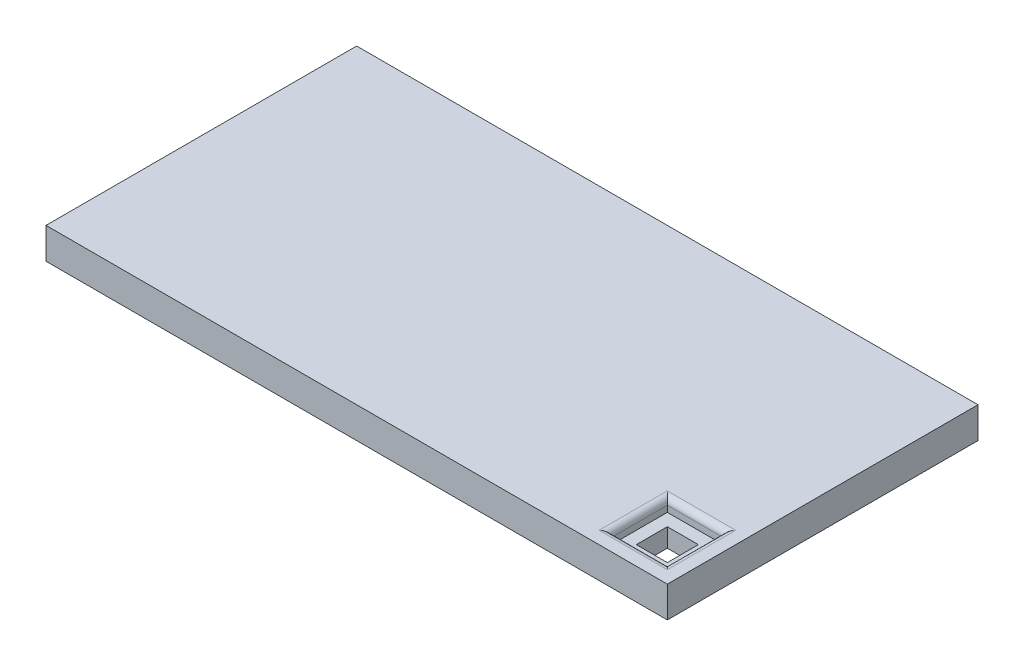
ISO-10303-21;
HEADER;
FILE_DESCRIPTION(('STEP AP214'),'2;1');
FILE_NAME('part.step','',(''),(''),'','','');
FILE_SCHEMA(('AUTOMOTIVE_DESIGN { 1 0 10303 214 1 1 1 1 }'));
ENDSEC;
DATA;
#1=APPLICATION_CONTEXT('core data for automotive mechanical design processes');
#2=APPLICATION_PROTOCOL_DEFINITION('international standard','automotive_design',2000,#1);
#3=PRODUCT_CONTEXT('',#1,'mechanical');
#4=PRODUCT('Part','Part','',(#3));
#5=PRODUCT_RELATED_PRODUCT_CATEGORY('part','',(#4));
#6=PRODUCT_DEFINITION_FORMATION('','',#4);
#7=PRODUCT_DEFINITION_CONTEXT('part definition',#1,'design');
#8=PRODUCT_DEFINITION('design','',#6,#7);
#9=PRODUCT_DEFINITION_SHAPE('','',#8);
#10=(LENGTH_UNIT() NAMED_UNIT(*) SI_UNIT(.MILLI.,.METRE.));
#11=(NAMED_UNIT(*) PLANE_ANGLE_UNIT() SI_UNIT($,.RADIAN.));
#12=(NAMED_UNIT(*) SI_UNIT($,.STERADIAN.) SOLID_ANGLE_UNIT());
#13=UNCERTAINTY_MEASURE_WITH_UNIT(LENGTH_MEASURE(1.E-05),#10,'distance_accuracy_value','');
#14=(GEOMETRIC_REPRESENTATION_CONTEXT(3) GLOBAL_UNCERTAINTY_ASSIGNED_CONTEXT((#13)) GLOBAL_UNIT_ASSIGNED_CONTEXT((#10,
#11,#12)) REPRESENTATION_CONTEXT('',''));
#15=CARTESIAN_POINT('',(0.,0.,0.));
#16=DIRECTION('',(0.,0.,1.));
#17=DIRECTION('',(1.,0.,0.));
#18=AXIS2_PLACEMENT_3D('',#15,#16,#17);
#19=CARTESIAN_POINT('',(-5.,0.,-4.99999999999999));
#20=DIRECTION('',(1.,0.,0.));
#21=DIRECTION('',(0.,0.,-1.));
#22=AXIS2_PLACEMENT_3D('',#19,#20,#21);
#23=PLANE('',#22);
#24=DIRECTION('',(0.,0.,1.));
#25=VECTOR('',#24,1.);
#26=CARTESIAN_POINT('',(-5.,3.,-4.99999999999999));
#27=LINE('',#26,#25);
#28=CARTESIAN_POINT('',(-5.,3.,-9.99999999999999));
#29=VERTEX_POINT('',#28);
#30=CARTESIAN_POINT('',(-5.,3.,-4.99999999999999));
#31=VERTEX_POINT('',#30);
#32=EDGE_CURVE('E174',#29,#31,#27,.T.);
#33=ORIENTED_EDGE('',*,*,#32,.F.);
#34=DIRECTION('',(0.,1.,0.));
#35=VECTOR('',#34,1.);
#36=CARTESIAN_POINT('',(-5.,0.,-9.99999999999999));
#37=LINE('',#36,#35);
#38=CARTESIAN_POINT('',(-5.,0.,-9.99999999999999));
#39=VERTEX_POINT('',#38);
#40=EDGE_CURVE('E188',#39,#29,#37,.T.);
#41=ORIENTED_EDGE('',*,*,#40,.F.);
#42=DIRECTION('',(0.,0.,-1.));
#43=VECTOR('',#42,1.);
#44=CARTESIAN_POINT('',(-5.,0.,-4.99999999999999));
#45=LINE('',#44,#43);
#46=CARTESIAN_POINT('',(-5.,0.,-4.99999999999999));
#47=VERTEX_POINT('',#46);
#48=EDGE_CURVE('E176',#47,#39,#45,.T.);
#49=ORIENTED_EDGE('',*,*,#48,.F.);
#50=DIRECTION('',(0.,1.,0.));
#51=VECTOR('',#50,1.);
#52=CARTESIAN_POINT('',(-5.,0.,-4.99999999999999));
#53=LINE('',#52,#51);
#54=EDGE_CURVE('E189',#47,#31,#53,.T.);
#55=ORIENTED_EDGE('',*,*,#54,.T.);
#56=EDGE_LOOP('',(#33,#41,#49,#55));
#57=FACE_BOUND('',#56,.T.);
#58=ADVANCED_FACE('F33',(#57),#23,.F.);
#59=CARTESIAN_POINT('',(-5.,0.,-4.99999999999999));
#60=DIRECTION('',(0.,0.,1.));
#61=DIRECTION('',(1.,0.,0.));
#62=AXIS2_PLACEMENT_3D('',#59,#60,#61);
#63=PLANE('',#62);
#64=DIRECTION('',(-1.,0.,0.));
#65=VECTOR('',#64,1.);
#66=CARTESIAN_POINT('',(-5.,3.,-4.99999999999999));
#67=LINE('',#66,#65);
#68=CARTESIAN_POINT('',(-10.,3.,-4.99999999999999));
#69=VERTEX_POINT('',#68);
#70=EDGE_CURVE('E172',#31,#69,#67,.T.);
#71=ORIENTED_EDGE('',*,*,#70,.F.);
#72=ORIENTED_EDGE('',*,*,#54,.F.);
#73=DIRECTION('',(1.,0.,0.));
#74=VECTOR('',#73,1.);
#75=CARTESIAN_POINT('',(-5.,0.,-4.99999999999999));
#76=LINE('',#75,#74);
#77=CARTESIAN_POINT('',(-10.,0.,-4.99999999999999));
#78=VERTEX_POINT('',#77);
#79=EDGE_CURVE('E185',#78,#47,#76,.T.);
#80=ORIENTED_EDGE('',*,*,#79,.F.);
#81=DIRECTION('',(0.,1.,0.));
#82=VECTOR('',#81,1.);
#83=CARTESIAN_POINT('',(-10.,0.,-4.99999999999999));
#84=LINE('',#83,#82);
#85=EDGE_CURVE('E193',#78,#69,#84,.T.);
#86=ORIENTED_EDGE('',*,*,#85,.T.);
#87=EDGE_LOOP('',(#71,#72,#80,#86));
#88=FACE_BOUND('',#87,.T.);
#89=ADVANCED_FACE('F279',(#88),#63,.F.);
#90=CARTESIAN_POINT('',(-10.,0.,-4.99999999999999));
#91=DIRECTION('',(-1.,0.,0.));
#92=DIRECTION('',(0.,0.,1.));
#93=AXIS2_PLACEMENT_3D('',#90,#91,#92);
#94=PLANE('',#93);
#95=DIRECTION('',(0.,0.,-1.));
#96=VECTOR('',#95,1.);
#97=CARTESIAN_POINT('',(-10.,3.,-4.99999999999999));
#98=LINE('',#97,#96);
#99=CARTESIAN_POINT('',(-10.,3.,-9.99999999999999));
#100=VERTEX_POINT('',#99);
#101=EDGE_CURVE('E167',#69,#100,#98,.T.);
#102=ORIENTED_EDGE('',*,*,#101,.F.);
#103=ORIENTED_EDGE('',*,*,#85,.F.);
#104=DIRECTION('',(0.,0.,1.));
#105=VECTOR('',#104,1.);
#106=CARTESIAN_POINT('',(-10.,0.,-4.99999999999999));
#107=LINE('',#106,#105);
#108=CARTESIAN_POINT('',(-10.,0.,-9.99999999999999));
#109=VERTEX_POINT('',#108);
#110=EDGE_CURVE('E182',#109,#78,#107,.T.);
#111=ORIENTED_EDGE('',*,*,#110,.F.);
#112=DIRECTION('',(0.,1.,0.));
#113=VECTOR('',#112,1.);
#114=CARTESIAN_POINT('',(-10.,0.,-9.99999999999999));
#115=LINE('',#114,#113);
#116=EDGE_CURVE('E196',#109,#100,#115,.T.);
#117=ORIENTED_EDGE('',*,*,#116,.T.);
#118=EDGE_LOOP('',(#102,#103,#111,#117));
#119=FACE_BOUND('',#118,.T.);
#120=ADVANCED_FACE('F285',(#119),#94,.F.);
#121=CARTESIAN_POINT('',(-5.,0.,-9.99999999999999));
#122=DIRECTION('',(0.,0.,-1.));
#123=DIRECTION('',(-1.,0.,0.));
#124=AXIS2_PLACEMENT_3D('',#121,#122,#123);
#125=PLANE('',#124);
#126=DIRECTION('',(1.,0.,0.));
#127=VECTOR('',#126,1.);
#128=CARTESIAN_POINT('',(-5.,3.,-9.99999999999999));
#129=LINE('',#128,#127);
#130=EDGE_CURVE('E230',#100,#29,#129,.T.);
#131=ORIENTED_EDGE('',*,*,#130,.F.);
#132=ORIENTED_EDGE('',*,*,#116,.F.);
#133=DIRECTION('',(-1.,0.,0.));
#134=VECTOR('',#133,1.);
#135=CARTESIAN_POINT('',(-5.,0.,-9.99999999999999));
#136=LINE('',#135,#134);
#137=EDGE_CURVE('E179',#39,#109,#136,.T.);
#138=ORIENTED_EDGE('',*,*,#137,.F.);
#139=ORIENTED_EDGE('',*,*,#40,.T.);
#140=EDGE_LOOP('',(#131,#132,#138,#139));
#141=FACE_BOUND('',#140,.T.);
#142=ADVANCED_FACE('F291',(#141),#125,.F.);
#143=CARTESIAN_POINT('',(0.,5.,0.));
#144=DIRECTION('',(-1.,0.,0.));
#145=DIRECTION('',(0.,0.,1.));
#146=AXIS2_PLACEMENT_3D('',#143,#144,#145);
#147=PLANE('',#146);
#148=DIRECTION('',(0.,0.,-1.));
#149=VECTOR('',#148,1.);
#150=CARTESIAN_POINT('',(0.,0.,0.));
#151=LINE('',#150,#149);
#152=CARTESIAN_POINT('',(0.,0.,0.));
#153=VERTEX_POINT('',#152);
#154=CARTESIAN_POINT('',(0.,0.,-50.));
#155=VERTEX_POINT('',#154);
#156=EDGE_CURVE('E192',#153,#155,#151,.T.);
#157=ORIENTED_EDGE('',*,*,#156,.T.);
#158=DIRECTION('',(0.,-1.,0.));
#159=VECTOR('',#158,1.);
#160=CARTESIAN_POINT('',(0.,5.,-50.));
#161=LINE('',#160,#159);
#162=CARTESIAN_POINT('',(0.,5.,-50.));
#163=VERTEX_POINT('',#162);
#164=EDGE_CURVE('E227',#163,#155,#161,.T.);
#165=ORIENTED_EDGE('',*,*,#164,.F.);
#166=DIRECTION('',(0.,0.,-1.));
#167=VECTOR('',#166,1.);
#168=CARTESIAN_POINT('',(0.,5.,0.));
#169=LINE('',#168,#167);
#170=CARTESIAN_POINT('',(0.,5.,0.));
#171=VERTEX_POINT('',#170);
#172=EDGE_CURVE('E209',#171,#163,#169,.T.);
#173=ORIENTED_EDGE('',*,*,#172,.F.);
#174=DIRECTION('',(0.,-1.,0.));
#175=VECTOR('',#174,1.);
#176=CARTESIAN_POINT('',(0.,5.,0.));
#177=LINE('',#176,#175);
#178=EDGE_CURVE('E218',#171,#153,#177,.T.);
#179=ORIENTED_EDGE('',*,*,#178,.T.);
#180=EDGE_LOOP('',(#157,#165,#173,#179));
#181=FACE_BOUND('',#180,.T.);
#182=ADVANCED_FACE('F35',(#181),#147,.F.);
#183=CARTESIAN_POINT('',(0.,5.,-50.));
#184=DIRECTION('',(0.,0.,1.));
#185=DIRECTION('',(1.,0.,0.));
#186=AXIS2_PLACEMENT_3D('',#183,#184,#185);
#187=PLANE('',#186);
#188=DIRECTION('',(-1.,0.,0.));
#189=VECTOR('',#188,1.);
#190=CARTESIAN_POINT('',(0.,0.,-50.));
#191=LINE('',#190,#189);
#192=CARTESIAN_POINT('',(-100.,0.,-50.));
#193=VERTEX_POINT('',#192);
#194=EDGE_CURVE('E203',#155,#193,#191,.T.);
#195=ORIENTED_EDGE('',*,*,#194,.T.);
#196=DIRECTION('',(0.,-1.,0.));
#197=VECTOR('',#196,1.);
#198=CARTESIAN_POINT('',(-100.,5.,-50.));
#199=LINE('',#198,#197);
#200=CARTESIAN_POINT('',(-100.,5.,-50.));
#201=VERTEX_POINT('',#200);
#202=EDGE_CURVE('E224',#201,#193,#199,.T.);
#203=ORIENTED_EDGE('',*,*,#202,.F.);
#204=DIRECTION('',(-1.,0.,0.));
#205=VECTOR('',#204,1.);
#206=CARTESIAN_POINT('',(0.,5.,-50.));
#207=LINE('',#206,#205);
#208=EDGE_CURVE('E212',#163,#201,#207,.T.);
#209=ORIENTED_EDGE('',*,*,#208,.F.);
#210=ORIENTED_EDGE('',*,*,#164,.T.);
#211=EDGE_LOOP('',(#195,#203,#209,#210));
#212=FACE_BOUND('',#211,.T.);
#213=ADVANCED_FACE('F305',(#212),#187,.F.);
#214=CARTESIAN_POINT('',(-100.,5.,0.));
#215=DIRECTION('',(1.,0.,0.));
#216=DIRECTION('',(0.,0.,-1.));
#217=AXIS2_PLACEMENT_3D('',#214,#215,#216);
#218=PLANE('',#217);
#219=DIRECTION('',(0.,0.,1.));
#220=VECTOR('',#219,1.);
#221=CARTESIAN_POINT('',(-100.,0.,0.));
#222=LINE('',#221,#220);
#223=CARTESIAN_POINT('',(-100.,0.,0.));
#224=VERTEX_POINT('',#223);
#225=EDGE_CURVE('E205',#193,#224,#222,.T.);
#226=ORIENTED_EDGE('',*,*,#225,.T.);
#227=DIRECTION('',(0.,-1.,0.));
#228=VECTOR('',#227,1.);
#229=CARTESIAN_POINT('',(-100.,5.,0.));
#230=LINE('',#229,#228);
#231=CARTESIAN_POINT('',(-100.,5.,0.));
#232=VERTEX_POINT('',#231);
#233=EDGE_CURVE('E221',#232,#224,#230,.T.);
#234=ORIENTED_EDGE('',*,*,#233,.F.);
#235=DIRECTION('',(0.,0.,1.));
#236=VECTOR('',#235,1.);
#237=CARTESIAN_POINT('',(-100.,5.,0.));
#238=LINE('',#237,#236);
#239=EDGE_CURVE('E214',#201,#232,#238,.T.);
#240=ORIENTED_EDGE('',*,*,#239,.F.);
#241=ORIENTED_EDGE('',*,*,#202,.T.);
#242=EDGE_LOOP('',(#226,#234,#240,#241));
#243=FACE_BOUND('',#242,.T.);
#244=ADVANCED_FACE('F302',(#243),#218,.F.);
#245=CARTESIAN_POINT('',(0.,5.,0.));
#246=DIRECTION('',(0.,0.,-1.));
#247=DIRECTION('',(-1.,0.,0.));
#248=AXIS2_PLACEMENT_3D('',#245,#246,#247);
#249=PLANE('',#248);
#250=DIRECTION('',(1.,0.,0.));
#251=VECTOR('',#250,1.);
#252=CARTESIAN_POINT('',(0.,0.,0.));
#253=LINE('',#252,#251);
#254=EDGE_CURVE('E207',#224,#153,#253,.T.);
#255=ORIENTED_EDGE('',*,*,#254,.T.);
#256=ORIENTED_EDGE('',*,*,#178,.F.);
#257=DIRECTION('',(1.,0.,0.));
#258=VECTOR('',#257,1.);
#259=CARTESIAN_POINT('',(0.,5.,0.));
#260=LINE('',#259,#258);
#261=EDGE_CURVE('E216',#232,#171,#260,.T.);
#262=ORIENTED_EDGE('',*,*,#261,.F.);
#263=ORIENTED_EDGE('',*,*,#233,.T.);
#264=EDGE_LOOP('',(#255,#256,#262,#263));
#265=FACE_BOUND('',#264,.T.);
#266=ADVANCED_FACE('F299',(#265),#249,.F.);
#267=CARTESIAN_POINT('',(0.,5.,0.));
#268=DIRECTION('',(0.,1.,0.));
#269=DIRECTION('',(0.,0.,1.));
#270=AXIS2_PLACEMENT_3D('',#267,#268,#269);
#271=PLANE('',#270);
#272=DIRECTION('',(0.,0.,-1.));
#273=VECTOR('',#272,1.);
#274=CARTESIAN_POINT('',(-2.,5.,-2.99999999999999));
#275=LINE('',#274,#273);
#276=CARTESIAN_POINT('',(-2.,5.,-13.));
#277=VERTEX_POINT('',#276);
#278=CARTESIAN_POINT('',(-2.,5.,-1.99999999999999));
#279=VERTEX_POINT('',#278);
#280=EDGE_CURVE('E237',#277,#279,#275,.F.);
#281=ORIENTED_EDGE('',*,*,#280,.T.);
#282=DIRECTION('',(1.,0.,0.));
#283=VECTOR('',#282,1.);
#284=CARTESIAN_POINT('',(-12.,5.,-1.99999999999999));
#285=LINE('',#284,#283);
#286=CARTESIAN_POINT('',(-13.,5.,-1.99999999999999));
#287=VERTEX_POINT('',#286);
#288=EDGE_CURVE('E239',#279,#287,#285,.F.);
#289=ORIENTED_EDGE('',*,*,#288,.T.);
#290=DIRECTION('',(0.,0.,1.));
#291=VECTOR('',#290,1.);
#292=CARTESIAN_POINT('',(-13.,5.,-12.));
#293=LINE('',#292,#291);
#294=CARTESIAN_POINT('',(-13.,5.,-13.));
#295=VERTEX_POINT('',#294);
#296=EDGE_CURVE('E233',#287,#295,#293,.F.);
#297=ORIENTED_EDGE('',*,*,#296,.T.);
#298=DIRECTION('',(-1.,0.,0.));
#299=VECTOR('',#298,1.);
#300=CARTESIAN_POINT('',(-3.,5.,-13.));
#301=LINE('',#300,#299);
#302=EDGE_CURVE('E235',#295,#277,#301,.F.);
#303=ORIENTED_EDGE('',*,*,#302,.T.);
#304=EDGE_LOOP('',(#281,#289,#297,#303));
#305=FACE_BOUND('',#304,.T.);
#306=ORIENTED_EDGE('',*,*,#172,.T.);
#307=ORIENTED_EDGE('',*,*,#208,.T.);
#308=ORIENTED_EDGE('',*,*,#239,.T.);
#309=ORIENTED_EDGE('',*,*,#261,.T.);
#310=EDGE_LOOP('',(#306,#307,#308,#309));
#311=FACE_BOUND('',#310,.T.);
#312=ADVANCED_FACE('F244',(#305,#311),#271,.T.);
#313=CARTESIAN_POINT('',(0.,0.,0.));
#314=DIRECTION('',(0.,1.,0.));
#315=DIRECTION('',(0.,0.,1.));
#316=AXIS2_PLACEMENT_3D('',#313,#314,#315);
#317=PLANE('',#316);
#318=ORIENTED_EDGE('',*,*,#79,.T.);
#319=ORIENTED_EDGE('',*,*,#48,.T.);
#320=ORIENTED_EDGE('',*,*,#137,.T.);
#321=ORIENTED_EDGE('',*,*,#110,.T.);
#322=EDGE_LOOP('',(#318,#319,#320,#321));
#323=FACE_BOUND('',#322,.T.);
#324=ORIENTED_EDGE('',*,*,#156,.F.);
#325=ORIENTED_EDGE('',*,*,#254,.F.);
#326=ORIENTED_EDGE('',*,*,#225,.F.);
#327=ORIENTED_EDGE('',*,*,#194,.F.);
#328=EDGE_LOOP('',(#324,#325,#326,#327));
#329=FACE_BOUND('',#328,.T.);
#330=ADVANCED_FACE('F293',(#323,#329),#317,.F.);
#331=CARTESIAN_POINT('',(-3.,3.,-2.99999999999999));
#332=DIRECTION('',(0.,1.,0.));
#333=DIRECTION('',(0.,0.,1.));
#334=AXIS2_PLACEMENT_3D('',#331,#332,#333);
#335=PLANE('',#334);
#336=DIRECTION('',(1.,0.,0.));
#337=VECTOR('',#336,1.);
#338=CARTESIAN_POINT('',(-12.,3.,-2.99999999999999));
#339=LINE('',#338,#337);
#340=CARTESIAN_POINT('',(-12.,3.,-2.99999999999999));
#341=VERTEX_POINT('',#340);
#342=CARTESIAN_POINT('',(-3.,3.,-2.99999999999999));
#343=VERTEX_POINT('',#342);
#344=EDGE_CURVE('E138',#341,#343,#339,.T.);
#345=ORIENTED_EDGE('',*,*,#344,.T.);
#346=DIRECTION('',(0.,0.,-1.));
#347=VECTOR('',#346,1.);
#348=CARTESIAN_POINT('',(-3.,3.,-2.99999999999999));
#349=LINE('',#348,#347);
#350=CARTESIAN_POINT('',(-3.,3.,-12.));
#351=VERTEX_POINT('',#350);
#352=EDGE_CURVE('E146',#343,#351,#349,.T.);
#353=ORIENTED_EDGE('',*,*,#352,.T.);
#354=DIRECTION('',(-1.,0.,0.));
#355=VECTOR('',#354,1.);
#356=CARTESIAN_POINT('',(-3.,3.,-12.));
#357=LINE('',#356,#355);
#358=CARTESIAN_POINT('',(-12.,3.,-12.));
#359=VERTEX_POINT('',#358);
#360=EDGE_CURVE('E151',#351,#359,#357,.T.);
#361=ORIENTED_EDGE('',*,*,#360,.T.);
#362=DIRECTION('',(0.,0.,1.));
#363=VECTOR('',#362,1.);
#364=CARTESIAN_POINT('',(-12.,3.,-12.));
#365=LINE('',#364,#363);
#366=EDGE_CURVE('E143',#359,#341,#365,.T.);
#367=ORIENTED_EDGE('',*,*,#366,.T.);
#368=EDGE_LOOP('',(#345,#353,#361,#367));
#369=FACE_BOUND('',#368,.T.);
#370=ORIENTED_EDGE('',*,*,#32,.T.);
#371=ORIENTED_EDGE('',*,*,#70,.T.);
#372=ORIENTED_EDGE('',*,*,#101,.T.);
#373=ORIENTED_EDGE('',*,*,#130,.T.);
#374=EDGE_LOOP('',(#370,#371,#372,#373));
#375=FACE_BOUND('',#374,.T.);
#376=ADVANCED_FACE('F153',(#369,#375),#335,.T.);
#377=CARTESIAN_POINT('',(-12.,3.,-2.99999999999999));
#378=DIRECTION('',(0.,0.,1.));
#379=DIRECTION('',(1.,0.,0.));
#380=AXIS2_PLACEMENT_3D('',#377,#378,#379);
#381=PLANE('',#380);
#382=DIRECTION('',(0.,1.,0.));
#383=VECTOR('',#382,1.);
#384=CARTESIAN_POINT('',(-12.,3.,-2.99999999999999));
#385=LINE('',#384,#383);
#386=CARTESIAN_POINT('',(-12.,4.,-2.99999999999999));
#387=VERTEX_POINT('',#386);
#388=EDGE_CURVE('E165',#341,#387,#385,.T.);
#389=ORIENTED_EDGE('',*,*,#388,.T.);
#390=DIRECTION('',(1.,0.,0.));
#391=VECTOR('',#390,1.);
#392=CARTESIAN_POINT('',(-3.,4.,-2.99999999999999));
#393=LINE('',#392,#391);
#394=CARTESIAN_POINT('',(-3.,4.,-2.99999999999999));
#395=VERTEX_POINT('',#394);
#396=EDGE_CURVE('E141',#387,#395,#393,.T.);
#397=ORIENTED_EDGE('',*,*,#396,.T.);
#398=DIRECTION('',(0.,1.,0.));
#399=VECTOR('',#398,1.);
#400=CARTESIAN_POINT('',(-3.,3.,-2.99999999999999));
#401=LINE('',#400,#399);
#402=EDGE_CURVE('E133',#343,#395,#401,.T.);
#403=ORIENTED_EDGE('',*,*,#402,.F.);
#404=ORIENTED_EDGE('',*,*,#344,.F.);
#405=EDGE_LOOP('',(#389,#397,#403,#404));
#406=FACE_BOUND('',#405,.T.);
#407=ADVANCED_FACE('F136',(#406),#381,.F.);
#408=CARTESIAN_POINT('',(-12.,3.,-12.));
#409=DIRECTION('',(-1.,0.,0.));
#410=DIRECTION('',(0.,0.,1.));
#411=AXIS2_PLACEMENT_3D('',#408,#409,#410);
#412=PLANE('',#411);
#413=DIRECTION('',(0.,1.,0.));
#414=VECTOR('',#413,1.);
#415=CARTESIAN_POINT('',(-12.,3.,-12.));
#416=LINE('',#415,#414);
#417=CARTESIAN_POINT('',(-12.,4.,-12.));
#418=VERTEX_POINT('',#417);
#419=EDGE_CURVE('E168',#359,#418,#416,.T.);
#420=ORIENTED_EDGE('',*,*,#419,.T.);
#421=DIRECTION('',(0.,0.,1.));
#422=VECTOR('',#421,1.);
#423=CARTESIAN_POINT('',(-12.,4.,-2.99999999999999));
#424=LINE('',#423,#422);
#425=EDGE_CURVE('E11',#418,#387,#424,.T.);
#426=ORIENTED_EDGE('',*,*,#425,.T.);
#427=ORIENTED_EDGE('',*,*,#388,.F.);
#428=ORIENTED_EDGE('',*,*,#366,.F.);
#429=EDGE_LOOP('',(#420,#426,#427,#428));
#430=FACE_BOUND('',#429,.T.);
#431=ADVANCED_FACE('F268',(#430),#412,.F.);
#432=CARTESIAN_POINT('',(-3.,3.,-12.));
#433=DIRECTION('',(0.,0.,-1.));
#434=DIRECTION('',(-1.,0.,0.));
#435=AXIS2_PLACEMENT_3D('',#432,#433,#434);
#436=PLANE('',#435);
#437=DIRECTION('',(0.,1.,0.));
#438=VECTOR('',#437,1.);
#439=CARTESIAN_POINT('',(-3.,3.,-12.));
#440=LINE('',#439,#438);
#441=CARTESIAN_POINT('',(-3.,4.,-12.));
#442=VERTEX_POINT('',#441);
#443=EDGE_CURVE('E142',#351,#442,#440,.T.);
#444=ORIENTED_EDGE('',*,*,#443,.T.);
#445=DIRECTION('',(-1.,0.,0.));
#446=VECTOR('',#445,1.);
#447=CARTESIAN_POINT('',(-12.,4.,-12.));
#448=LINE('',#447,#446);
#449=EDGE_CURVE('E41',#442,#418,#448,.T.);
#450=ORIENTED_EDGE('',*,*,#449,.T.);
#451=ORIENTED_EDGE('',*,*,#419,.F.);
#452=ORIENTED_EDGE('',*,*,#360,.F.);
#453=EDGE_LOOP('',(#444,#450,#451,#452));
#454=FACE_BOUND('',#453,.T.);
#455=ADVANCED_FACE('F269',(#454),#436,.F.);
#456=CARTESIAN_POINT('',(-3.,3.,-2.99999999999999));
#457=DIRECTION('',(1.,0.,0.));
#458=DIRECTION('',(0.,0.,-1.));
#459=AXIS2_PLACEMENT_3D('',#456,#457,#458);
#460=PLANE('',#459);
#461=ORIENTED_EDGE('',*,*,#402,.T.);
#462=DIRECTION('',(0.,0.,-1.));
#463=VECTOR('',#462,1.);
#464=CARTESIAN_POINT('',(-3.,4.,-12.));
#465=LINE('',#464,#463);
#466=EDGE_CURVE('E55',#395,#442,#465,.T.);
#467=ORIENTED_EDGE('',*,*,#466,.T.);
#468=ORIENTED_EDGE('',*,*,#443,.F.);
#469=ORIENTED_EDGE('',*,*,#352,.F.);
#470=EDGE_LOOP('',(#461,#467,#468,#469));
#471=FACE_BOUND('',#470,.T.);
#472=ADVANCED_FACE('F147',(#471),#460,.F.);
#473=CARTESIAN_POINT('',(-3.,4.,-13.));
#474=DIRECTION('',(1.,0.,0.));
#475=DIRECTION('',(0.,0.,-1.));
#476=AXIS2_PLACEMENT_3D('',#473,#474,#475);
#477=CYLINDRICAL_SURFACE('',#476,1.);
#478=CARTESIAN_POINT('',(-2.,4.,-13.));
#479=DIRECTION('',(0.707106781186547,0.,0.707106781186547));
#480=DIRECTION('',(-0.707106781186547,0.,0.707106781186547));
#481=AXIS2_PLACEMENT_3D('',#478,#479,#480);
#482=ELLIPSE('',#481,1.41421356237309,1.);
#483=EDGE_CURVE('E159',#277,#442,#482,.T.);
#484=ORIENTED_EDGE('',*,*,#483,.F.);
#485=ORIENTED_EDGE('',*,*,#302,.F.);
#486=CARTESIAN_POINT('',(-13.,4.,-13.));
#487=DIRECTION('',(0.707106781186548,0.,-0.707106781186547));
#488=DIRECTION('',(0.707106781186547,0.,0.707106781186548));
#489=AXIS2_PLACEMENT_3D('',#486,#487,#488);
#490=ELLIPSE('',#489,1.41421356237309,1.);
#491=EDGE_CURVE('E156',#418,#295,#490,.F.);
#492=ORIENTED_EDGE('',*,*,#491,.F.);
#493=ORIENTED_EDGE('',*,*,#449,.F.);
#494=EDGE_LOOP('',(#484,#485,#492,#493));
#495=FACE_BOUND('',#494,.T.);
#496=ADVANCED_FACE('F262',(#495),#477,.T.);
#497=CARTESIAN_POINT('',(-13.,4.,-12.));
#498=DIRECTION('',(0.,0.,-1.));
#499=DIRECTION('',(-1.,0.,0.));
#500=AXIS2_PLACEMENT_3D('',#497,#498,#499);
#501=CYLINDRICAL_SURFACE('',#500,1.);
#502=ORIENTED_EDGE('',*,*,#491,.T.);
#503=ORIENTED_EDGE('',*,*,#296,.F.);
#504=CARTESIAN_POINT('',(-13.,4.,-1.99999999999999));
#505=DIRECTION('',(-0.707106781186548,0.,-0.707106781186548));
#506=DIRECTION('',(-0.707106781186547,0.,0.707106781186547));
#507=AXIS2_PLACEMENT_3D('',#504,#505,#506);
#508=ELLIPSE('',#507,1.4142135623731,1.);
#509=EDGE_CURVE('E254',#387,#287,#508,.F.);
#510=ORIENTED_EDGE('',*,*,#509,.F.);
#511=ORIENTED_EDGE('',*,*,#425,.F.);
#512=EDGE_LOOP('',(#502,#503,#510,#511));
#513=FACE_BOUND('',#512,.T.);
#514=ADVANCED_FACE('F266',(#513),#501,.T.);
#515=CARTESIAN_POINT('',(-2.,4.,-2.99999999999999));
#516=DIRECTION('',(0.,0.,1.));
#517=DIRECTION('',(1.,0.,0.));
#518=AXIS2_PLACEMENT_3D('',#515,#516,#517);
#519=CYLINDRICAL_SURFACE('',#518,1.);
#520=ORIENTED_EDGE('',*,*,#483,.T.);
#521=ORIENTED_EDGE('',*,*,#466,.F.);
#522=CARTESIAN_POINT('',(-2.,4.,-1.99999999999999));
#523=DIRECTION('',(-0.707106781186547,0.,0.707106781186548));
#524=DIRECTION('',(-0.707106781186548,0.,-0.707106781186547));
#525=AXIS2_PLACEMENT_3D('',#522,#523,#524);
#526=ELLIPSE('',#525,1.41421356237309,1.);
#527=EDGE_CURVE('E252',#279,#395,#526,.T.);
#528=ORIENTED_EDGE('',*,*,#527,.F.);
#529=ORIENTED_EDGE('',*,*,#280,.F.);
#530=EDGE_LOOP('',(#520,#521,#528,#529));
#531=FACE_BOUND('',#530,.T.);
#532=ADVANCED_FACE('F257',(#531),#519,.T.);
#533=CARTESIAN_POINT('',(-12.,4.,-1.99999999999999));
#534=DIRECTION('',(-1.,0.,0.));
#535=DIRECTION('',(0.,0.,1.));
#536=AXIS2_PLACEMENT_3D('',#533,#534,#535);
#537=CYLINDRICAL_SURFACE('',#536,1.);
#538=ORIENTED_EDGE('',*,*,#509,.T.);
#539=ORIENTED_EDGE('',*,*,#288,.F.);
#540=ORIENTED_EDGE('',*,*,#527,.T.);
#541=ORIENTED_EDGE('',*,*,#396,.F.);
#542=EDGE_LOOP('',(#538,#539,#540,#541));
#543=FACE_BOUND('',#542,.T.);
#544=ADVANCED_FACE('F251',(#543),#537,.T.);
#545=CLOSED_SHELL('',(#58,#89,#120,#142,#182,#213,#244,#266,#312,#330,#376,#407,#431,#455,#472,
#496,#514,#532,#544));
#546=MANIFOLD_SOLID_BREP('B2',#545);
#547=ADVANCED_BREP_SHAPE_REPRESENTATION('',(#18,#546),#14);
#548=SHAPE_DEFINITION_REPRESENTATION(#9,#547);
ENDSEC;
END-ISO-10303-21;
